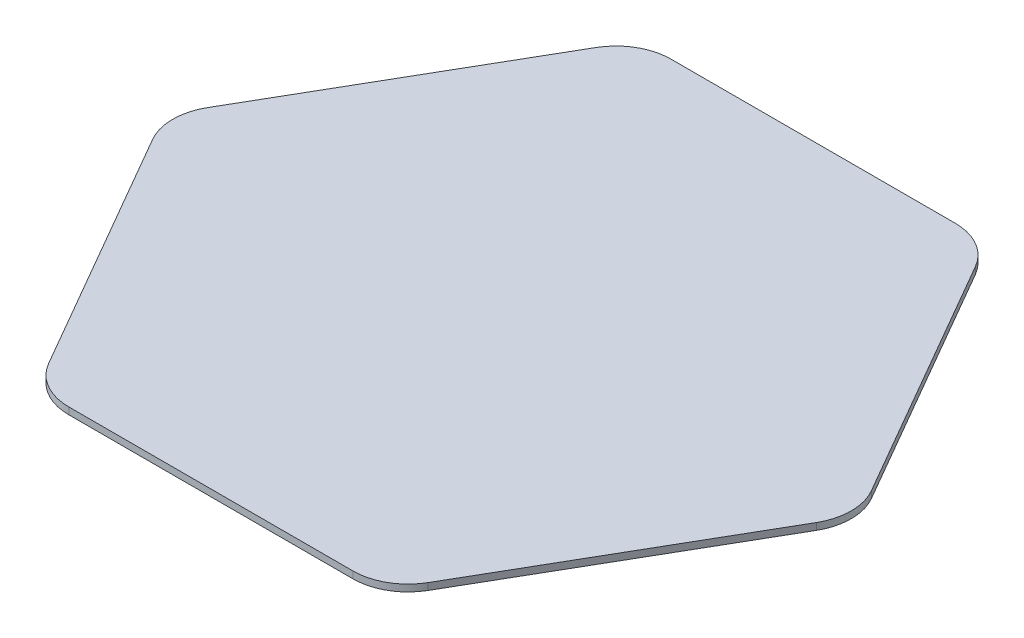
ISO-10303-21;
HEADER;
FILE_DESCRIPTION(('STEP AP214'),'2;1');
FILE_NAME('part.step','',(''),(''),'','','');
FILE_SCHEMA(('AUTOMOTIVE_DESIGN { 1 0 10303 214 1 1 1 1 }'));
ENDSEC;
DATA;
#1=APPLICATION_CONTEXT('core data for automotive mechanical design processes');
#2=APPLICATION_PROTOCOL_DEFINITION('international standard','automotive_design',2000,#1);
#3=PRODUCT_CONTEXT('',#1,'mechanical');
#4=PRODUCT('Part','Part','',(#3));
#5=PRODUCT_RELATED_PRODUCT_CATEGORY('part','',(#4));
#6=PRODUCT_DEFINITION_FORMATION('','',#4);
#7=PRODUCT_DEFINITION_CONTEXT('part definition',#1,'design');
#8=PRODUCT_DEFINITION('design','',#6,#7);
#9=PRODUCT_DEFINITION_SHAPE('','',#8);
#10=(LENGTH_UNIT() NAMED_UNIT(*) SI_UNIT(.MILLI.,.METRE.));
#11=(NAMED_UNIT(*) PLANE_ANGLE_UNIT() SI_UNIT($,.RADIAN.));
#12=(NAMED_UNIT(*) SI_UNIT($,.STERADIAN.) SOLID_ANGLE_UNIT());
#13=UNCERTAINTY_MEASURE_WITH_UNIT(LENGTH_MEASURE(1.E-05),#10,'distance_accuracy_value','');
#14=(GEOMETRIC_REPRESENTATION_CONTEXT(3) GLOBAL_UNCERTAINTY_ASSIGNED_CONTEXT((#13)) GLOBAL_UNIT_ASSIGNED_CONTEXT((#10,
#11,#12)) REPRESENTATION_CONTEXT('',''));
#15=CARTESIAN_POINT('',(0.,0.,0.));
#16=DIRECTION('',(0.,0.,1.));
#17=DIRECTION('',(1.,0.,0.));
#18=AXIS2_PLACEMENT_3D('',#15,#16,#17);
#19=CARTESIAN_POINT('',(-41.569219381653,2.,-72.));
#20=DIRECTION('',(0.,-1.,0.));
#21=DIRECTION('',(0.,0.,-1.));
#22=AXIS2_PLACEMENT_3D('',#19,#20,#21);
#23=CYLINDRICAL_SURFACE('',#22,16.1);
#24=CARTESIAN_POINT('',(-41.569219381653,0.,-72.));
#25=DIRECTION('',(0.,1.,0.));
#26=DIRECTION('',(0.,0.,1.));
#27=AXIS2_PLACEMENT_3D('',#24,#25,#26);
#28=CIRCLE('',#27,16.1);
#29=CARTESIAN_POINT('',(-41.5692193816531,0.,-88.1));
#30=VERTEX_POINT('',#29);
#31=CARTESIAN_POINT('',(-55.5122283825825,0.,-80.05));
#32=VERTEX_POINT('',#31);
#33=EDGE_CURVE('E159',#30,#32,#28,.T.);
#34=ORIENTED_EDGE('',*,*,#33,.T.);
#35=DIRECTION('',(0.,-1.,0.));
#36=VECTOR('',#35,1.);
#37=CARTESIAN_POINT('',(-55.5122283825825,2.,-80.05));
#38=LINE('',#37,#36);
#39=CARTESIAN_POINT('',(-55.5122283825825,2.,-80.05));
#40=VERTEX_POINT('',#39);
#41=EDGE_CURVE('E11',#40,#32,#38,.T.);
#42=ORIENTED_EDGE('',*,*,#41,.F.);
#43=CARTESIAN_POINT('',(-41.569219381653,2.,-72.));
#44=DIRECTION('',(0.,1.,0.));
#45=DIRECTION('',(0.,0.,1.));
#46=AXIS2_PLACEMENT_3D('',#43,#44,#45);
#47=CIRCLE('',#46,16.1);
#48=CARTESIAN_POINT('',(-41.5692193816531,2.,-88.1));
#49=VERTEX_POINT('',#48);
#50=EDGE_CURVE('E181',#49,#40,#47,.T.);
#51=ORIENTED_EDGE('',*,*,#50,.F.);
#52=DIRECTION('',(0.,-1.,0.));
#53=VECTOR('',#52,1.);
#54=CARTESIAN_POINT('',(-41.5692193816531,2.,-88.1));
#55=LINE('',#54,#53);
#56=EDGE_CURVE('E155',#49,#30,#55,.T.);
#57=ORIENTED_EDGE('',*,*,#56,.T.);
#58=EDGE_LOOP('',(#34,#42,#51,#57));
#59=FACE_BOUND('',#58,.T.);
#60=ADVANCED_FACE('F39',(#59),#23,.T.);
#61=CARTESIAN_POINT('',(-55.5122283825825,2.,-80.05));
#62=DIRECTION('',(0.866025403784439,0.,0.5));
#63=DIRECTION('',(0.499999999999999,0.,-0.866025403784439));
#64=AXIS2_PLACEMENT_3D('',#61,#62,#63);
#65=PLANE('',#64);
#66=DIRECTION('',(-0.499999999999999,0.,0.866025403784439));
#67=VECTOR('',#66,1.);
#68=CARTESIAN_POINT('',(-55.5122283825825,0.,-80.05));
#69=LINE('',#68,#67);
#70=CARTESIAN_POINT('',(-97.0814477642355,0.,-8.04999999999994));
#71=VERTEX_POINT('',#70);
#72=EDGE_CURVE('E162',#32,#71,#69,.T.);
#73=ORIENTED_EDGE('',*,*,#72,.T.);
#74=DIRECTION('',(0.,-1.,0.));
#75=VECTOR('',#74,1.);
#76=CARTESIAN_POINT('',(-97.0814477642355,2.,-8.04999999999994));
#77=LINE('',#76,#75);
#78=CARTESIAN_POINT('',(-97.0814477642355,2.,-8.04999999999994));
#79=VERTEX_POINT('',#78);
#80=EDGE_CURVE('E47',#79,#71,#77,.T.);
#81=ORIENTED_EDGE('',*,*,#80,.F.);
#82=DIRECTION('',(-0.499999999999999,0.,0.866025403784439));
#83=VECTOR('',#82,1.);
#84=CARTESIAN_POINT('',(-55.5122283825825,2.,-80.05));
#85=LINE('',#84,#83);
#86=EDGE_CURVE('E110',#40,#79,#85,.T.);
#87=ORIENTED_EDGE('',*,*,#86,.F.);
#88=ORIENTED_EDGE('',*,*,#41,.T.);
#89=EDGE_LOOP('',(#73,#81,#87,#88));
#90=FACE_BOUND('',#89,.T.);
#91=ADVANCED_FACE('F259',(#90),#65,.F.);
#92=CARTESIAN_POINT('',(-83.1384387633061,2.,0.));
#93=DIRECTION('',(0.,-1.,0.));
#94=DIRECTION('',(0.,0.,-1.));
#95=AXIS2_PLACEMENT_3D('',#92,#93,#94);
#96=CYLINDRICAL_SURFACE('',#95,16.1);
#97=CARTESIAN_POINT('',(-83.1384387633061,0.,0.));
#98=DIRECTION('',(0.,1.,0.));
#99=DIRECTION('',(0.,0.,1.));
#100=AXIS2_PLACEMENT_3D('',#97,#98,#99);
#101=CIRCLE('',#100,16.1);
#102=CARTESIAN_POINT('',(-97.0814477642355,0.,8.05000000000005));
#103=VERTEX_POINT('',#102);
#104=EDGE_CURVE('E164',#71,#103,#101,.T.);
#105=ORIENTED_EDGE('',*,*,#104,.T.);
#106=DIRECTION('',(0.,-1.,0.));
#107=VECTOR('',#106,1.);
#108=CARTESIAN_POINT('',(-97.0814477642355,2.,8.05000000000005));
#109=LINE('',#108,#107);
#110=CARTESIAN_POINT('',(-97.0814477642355,2.,8.05000000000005));
#111=VERTEX_POINT('',#110);
#112=EDGE_CURVE('E200',#111,#103,#109,.T.);
#113=ORIENTED_EDGE('',*,*,#112,.F.);
#114=CARTESIAN_POINT('',(-83.1384387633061,2.,0.));
#115=DIRECTION('',(0.,1.,0.));
#116=DIRECTION('',(0.,0.,1.));
#117=AXIS2_PLACEMENT_3D('',#114,#115,#116);
#118=CIRCLE('',#117,16.1);
#119=EDGE_CURVE('E208',#79,#111,#118,.T.);
#120=ORIENTED_EDGE('',*,*,#119,.F.);
#121=ORIENTED_EDGE('',*,*,#80,.T.);
#122=EDGE_LOOP('',(#105,#113,#120,#121));
#123=FACE_BOUND('',#122,.T.);
#124=ADVANCED_FACE('F206',(#123),#96,.T.);
#125=CARTESIAN_POINT('',(-97.0814477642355,2.,8.05000000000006));
#126=DIRECTION('',(0.866025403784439,0.,-0.5));
#127=DIRECTION('',(-0.5,0.,-0.866025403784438));
#128=AXIS2_PLACEMENT_3D('',#125,#126,#127);
#129=PLANE('',#128);
#130=DIRECTION('',(0.5,0.,0.866025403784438));
#131=VECTOR('',#130,1.);
#132=CARTESIAN_POINT('',(-97.0814477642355,0.,8.05000000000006));
#133=LINE('',#132,#131);
#134=CARTESIAN_POINT('',(-55.5122283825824,0.,80.05));
#135=VERTEX_POINT('',#134);
#136=EDGE_CURVE('E166',#103,#135,#133,.T.);
#137=ORIENTED_EDGE('',*,*,#136,.T.);
#138=DIRECTION('',(0.,-1.,0.));
#139=VECTOR('',#138,1.);
#140=CARTESIAN_POINT('',(-55.5122283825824,2.,80.05));
#141=LINE('',#140,#139);
#142=CARTESIAN_POINT('',(-55.5122283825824,2.,80.05));
#143=VERTEX_POINT('',#142);
#144=EDGE_CURVE('E197',#143,#135,#141,.T.);
#145=ORIENTED_EDGE('',*,*,#144,.F.);
#146=DIRECTION('',(0.5,0.,0.866025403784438));
#147=VECTOR('',#146,1.);
#148=CARTESIAN_POINT('',(-97.0814477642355,2.,8.05000000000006));
#149=LINE('',#148,#147);
#150=EDGE_CURVE('E226',#111,#143,#149,.T.);
#151=ORIENTED_EDGE('',*,*,#150,.F.);
#152=ORIENTED_EDGE('',*,*,#112,.T.);
#153=EDGE_LOOP('',(#137,#145,#151,#152));
#154=FACE_BOUND('',#153,.T.);
#155=ADVANCED_FACE('F217',(#154),#129,.F.);
#156=CARTESIAN_POINT('',(-41.569219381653,2.,72.));
#157=DIRECTION('',(0.,-1.,0.));
#158=DIRECTION('',(0.,0.,-1.));
#159=AXIS2_PLACEMENT_3D('',#156,#157,#158);
#160=CYLINDRICAL_SURFACE('',#159,16.1);
#161=CARTESIAN_POINT('',(-41.569219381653,0.,72.));
#162=DIRECTION('',(0.,1.,0.));
#163=DIRECTION('',(0.,0.,1.));
#164=AXIS2_PLACEMENT_3D('',#161,#162,#163);
#165=CIRCLE('',#164,16.1);
#166=CARTESIAN_POINT('',(-41.569219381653,0.,88.1));
#167=VERTEX_POINT('',#166);
#168=EDGE_CURVE('E168',#135,#167,#165,.T.);
#169=ORIENTED_EDGE('',*,*,#168,.T.);
#170=DIRECTION('',(0.,-1.,0.));
#171=VECTOR('',#170,1.);
#172=CARTESIAN_POINT('',(-41.569219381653,2.,88.1));
#173=LINE('',#172,#171);
#174=CARTESIAN_POINT('',(-41.569219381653,2.,88.1));
#175=VERTEX_POINT('',#174);
#176=EDGE_CURVE('E194',#175,#167,#173,.T.);
#177=ORIENTED_EDGE('',*,*,#176,.F.);
#178=CARTESIAN_POINT('',(-41.569219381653,2.,72.));
#179=DIRECTION('',(0.,1.,0.));
#180=DIRECTION('',(0.,0.,1.));
#181=AXIS2_PLACEMENT_3D('',#178,#179,#180);
#182=CIRCLE('',#181,16.1);
#183=EDGE_CURVE('E223',#143,#175,#182,.T.);
#184=ORIENTED_EDGE('',*,*,#183,.F.);
#185=ORIENTED_EDGE('',*,*,#144,.T.);
#186=EDGE_LOOP('',(#169,#177,#184,#185));
#187=FACE_BOUND('',#186,.T.);
#188=ADVANCED_FACE('F221',(#187),#160,.T.);
#189=CARTESIAN_POINT('',(-41.569219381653,2.,88.1));
#190=DIRECTION('',(0.,0.,-1.));
#191=DIRECTION('',(-1.,0.,0.));
#192=AXIS2_PLACEMENT_3D('',#189,#190,#191);
#193=PLANE('',#192);
#194=DIRECTION('',(1.,0.,0.));
#195=VECTOR('',#194,1.);
#196=CARTESIAN_POINT('',(-41.569219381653,0.,88.1));
#197=LINE('',#196,#195);
#198=CARTESIAN_POINT('',(41.5692193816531,0.,88.1));
#199=VERTEX_POINT('',#198);
#200=EDGE_CURVE('E170',#167,#199,#197,.T.);
#201=ORIENTED_EDGE('',*,*,#200,.T.);
#202=DIRECTION('',(0.,-1.,0.));
#203=VECTOR('',#202,1.);
#204=CARTESIAN_POINT('',(41.5692193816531,2.,88.1));
#205=LINE('',#204,#203);
#206=CARTESIAN_POINT('',(41.5692193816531,2.,88.1));
#207=VERTEX_POINT('',#206);
#208=EDGE_CURVE('E191',#207,#199,#205,.T.);
#209=ORIENTED_EDGE('',*,*,#208,.F.);
#210=DIRECTION('',(1.,0.,0.));
#211=VECTOR('',#210,1.);
#212=CARTESIAN_POINT('',(-41.569219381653,2.,88.1));
#213=LINE('',#212,#211);
#214=EDGE_CURVE('E225',#175,#207,#213,.T.);
#215=ORIENTED_EDGE('',*,*,#214,.F.);
#216=ORIENTED_EDGE('',*,*,#176,.T.);
#217=EDGE_LOOP('',(#201,#209,#215,#216));
#218=FACE_BOUND('',#217,.T.);
#219=ADVANCED_FACE('F272',(#218),#193,.F.);
#220=CARTESIAN_POINT('',(41.5692193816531,2.,72.));
#221=DIRECTION('',(0.,-1.,0.));
#222=DIRECTION('',(0.,0.,-1.));
#223=AXIS2_PLACEMENT_3D('',#220,#221,#222);
#224=CYLINDRICAL_SURFACE('',#223,16.1);
#225=CARTESIAN_POINT('',(41.5692193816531,0.,72.));
#226=DIRECTION('',(0.,1.,0.));
#227=DIRECTION('',(0.,0.,1.));
#228=AXIS2_PLACEMENT_3D('',#225,#226,#227);
#229=CIRCLE('',#228,16.1);
#230=CARTESIAN_POINT('',(55.5122283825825,0.,80.05));
#231=VERTEX_POINT('',#230);
#232=EDGE_CURVE('E172',#199,#231,#229,.T.);
#233=ORIENTED_EDGE('',*,*,#232,.T.);
#234=DIRECTION('',(0.,-1.,0.));
#235=VECTOR('',#234,1.);
#236=CARTESIAN_POINT('',(55.5122283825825,2.,80.05));
#237=LINE('',#236,#235);
#238=CARTESIAN_POINT('',(55.5122283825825,2.,80.05));
#239=VERTEX_POINT('',#238);
#240=EDGE_CURVE('E188',#239,#231,#237,.T.);
#241=ORIENTED_EDGE('',*,*,#240,.F.);
#242=CARTESIAN_POINT('',(41.5692193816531,2.,72.));
#243=DIRECTION('',(0.,1.,0.));
#244=DIRECTION('',(0.,0.,1.));
#245=AXIS2_PLACEMENT_3D('',#242,#243,#244);
#246=CIRCLE('',#245,16.1);
#247=EDGE_CURVE('E228',#207,#239,#246,.T.);
#248=ORIENTED_EDGE('',*,*,#247,.F.);
#249=ORIENTED_EDGE('',*,*,#208,.T.);
#250=EDGE_LOOP('',(#233,#241,#248,#249));
#251=FACE_BOUND('',#250,.T.);
#252=ADVANCED_FACE('F275',(#251),#224,.T.);
#253=CARTESIAN_POINT('',(55.5122283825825,2.,80.05));
#254=DIRECTION('',(-0.866025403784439,0.,-0.499999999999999));
#255=DIRECTION('',(-0.499999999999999,0.,0.866025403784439));
#256=AXIS2_PLACEMENT_3D('',#253,#254,#255);
#257=PLANE('',#256);
#258=DIRECTION('',(0.499999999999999,0.,-0.866025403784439));
#259=VECTOR('',#258,1.);
#260=CARTESIAN_POINT('',(55.5122283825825,0.,80.05));
#261=LINE('',#260,#259);
#262=CARTESIAN_POINT('',(97.0814477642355,0.,8.0499999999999));
#263=VERTEX_POINT('',#262);
#264=EDGE_CURVE('E174',#231,#263,#261,.T.);
#265=ORIENTED_EDGE('',*,*,#264,.T.);
#266=DIRECTION('',(0.,-1.,0.));
#267=VECTOR('',#266,1.);
#268=CARTESIAN_POINT('',(97.0814477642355,2.,8.0499999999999));
#269=LINE('',#268,#267);
#270=CARTESIAN_POINT('',(97.0814477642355,2.,8.0499999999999));
#271=VERTEX_POINT('',#270);
#272=EDGE_CURVE('E185',#271,#263,#269,.T.);
#273=ORIENTED_EDGE('',*,*,#272,.F.);
#274=DIRECTION('',(0.499999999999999,0.,-0.866025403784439));
#275=VECTOR('',#274,1.);
#276=CARTESIAN_POINT('',(55.5122283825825,2.,80.05));
#277=LINE('',#276,#275);
#278=EDGE_CURVE('E234',#239,#271,#277,.T.);
#279=ORIENTED_EDGE('',*,*,#278,.F.);
#280=ORIENTED_EDGE('',*,*,#240,.T.);
#281=EDGE_LOOP('',(#265,#273,#279,#280));
#282=FACE_BOUND('',#281,.T.);
#283=ADVANCED_FACE('F240',(#282),#257,.F.);
#284=CARTESIAN_POINT('',(83.1384387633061,2.,0.));
#285=DIRECTION('',(0.,-1.,0.));
#286=DIRECTION('',(0.,0.,-1.));
#287=AXIS2_PLACEMENT_3D('',#284,#285,#286);
#288=CYLINDRICAL_SURFACE('',#287,16.1);
#289=CARTESIAN_POINT('',(83.1384387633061,0.,0.));
#290=DIRECTION('',(0.,1.,0.));
#291=DIRECTION('',(0.,0.,-1.));
#292=AXIS2_PLACEMENT_3D('',#289,#290,#291);
#293=CIRCLE('',#292,16.1);
#294=CARTESIAN_POINT('',(97.0814477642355,0.,-8.05000000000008));
#295=VERTEX_POINT('',#294);
#296=EDGE_CURVE('E176',#263,#295,#293,.T.);
#297=ORIENTED_EDGE('',*,*,#296,.T.);
#298=DIRECTION('',(0.,-1.,0.));
#299=VECTOR('',#298,1.);
#300=CARTESIAN_POINT('',(97.0814477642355,2.,-8.05000000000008));
#301=LINE('',#300,#299);
#302=CARTESIAN_POINT('',(97.0814477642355,2.,-8.05000000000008));
#303=VERTEX_POINT('',#302);
#304=EDGE_CURVE('E150',#303,#295,#301,.T.);
#305=ORIENTED_EDGE('',*,*,#304,.F.);
#306=CARTESIAN_POINT('',(83.1384387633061,2.,0.));
#307=DIRECTION('',(0.,1.,0.));
#308=DIRECTION('',(0.,0.,-1.));
#309=AXIS2_PLACEMENT_3D('',#306,#307,#308);
#310=CIRCLE('',#309,16.1);
#311=EDGE_CURVE('E141',#271,#303,#310,.T.);
#312=ORIENTED_EDGE('',*,*,#311,.F.);
#313=ORIENTED_EDGE('',*,*,#272,.T.);
#314=EDGE_LOOP('',(#297,#305,#312,#313));
#315=FACE_BOUND('',#314,.T.);
#316=ADVANCED_FACE('F244',(#315),#288,.T.);
#317=CARTESIAN_POINT('',(97.0814477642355,2.,-8.05000000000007));
#318=DIRECTION('',(-0.866025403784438,0.,0.5));
#319=DIRECTION('',(0.5,0.,0.866025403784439));
#320=AXIS2_PLACEMENT_3D('',#317,#318,#319);
#321=PLANE('',#320);
#322=DIRECTION('',(-0.5,0.,-0.866025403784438));
#323=VECTOR('',#322,1.);
#324=CARTESIAN_POINT('',(97.0814477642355,0.,-8.05000000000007));
#325=LINE('',#324,#323);
#326=CARTESIAN_POINT('',(55.5122283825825,0.,-80.05));
#327=VERTEX_POINT('',#326);
#328=EDGE_CURVE('E149',#295,#327,#325,.T.);
#329=ORIENTED_EDGE('',*,*,#328,.T.);
#330=DIRECTION('',(0.,-1.,0.));
#331=VECTOR('',#330,1.);
#332=CARTESIAN_POINT('',(55.5122283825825,2.,-80.05));
#333=LINE('',#332,#331);
#334=CARTESIAN_POINT('',(55.5122283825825,2.,-80.05));
#335=VERTEX_POINT('',#334);
#336=EDGE_CURVE('E146',#335,#327,#333,.T.);
#337=ORIENTED_EDGE('',*,*,#336,.F.);
#338=DIRECTION('',(-0.5,0.,-0.866025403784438));
#339=VECTOR('',#338,1.);
#340=CARTESIAN_POINT('',(97.0814477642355,2.,-8.05000000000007));
#341=LINE('',#340,#339);
#342=EDGE_CURVE('E135',#303,#335,#341,.T.);
#343=ORIENTED_EDGE('',*,*,#342,.F.);
#344=ORIENTED_EDGE('',*,*,#304,.T.);
#345=EDGE_LOOP('',(#329,#337,#343,#344));
#346=FACE_BOUND('',#345,.T.);
#347=ADVANCED_FACE('F147',(#346),#321,.F.);
#348=CARTESIAN_POINT('',(41.5692193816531,2.,-72.));
#349=DIRECTION('',(0.,-1.,0.));
#350=DIRECTION('',(0.,0.,-1.));
#351=AXIS2_PLACEMENT_3D('',#348,#349,#350);
#352=CYLINDRICAL_SURFACE('',#351,16.1);
#353=CARTESIAN_POINT('',(41.5692193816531,0.,-72.));
#354=DIRECTION('',(0.,1.,0.));
#355=DIRECTION('',(0.,0.,1.));
#356=AXIS2_PLACEMENT_3D('',#353,#354,#355);
#357=CIRCLE('',#356,16.1);
#358=CARTESIAN_POINT('',(41.5692193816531,0.,-88.1));
#359=VERTEX_POINT('',#358);
#360=EDGE_CURVE('E96',#327,#359,#357,.T.);
#361=ORIENTED_EDGE('',*,*,#360,.T.);
#362=DIRECTION('',(0.,-1.,0.));
#363=VECTOR('',#362,1.);
#364=CARTESIAN_POINT('',(41.5692193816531,2.,-88.1));
#365=LINE('',#364,#363);
#366=CARTESIAN_POINT('',(41.5692193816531,2.,-88.1));
#367=VERTEX_POINT('',#366);
#368=EDGE_CURVE('E151',#367,#359,#365,.T.);
#369=ORIENTED_EDGE('',*,*,#368,.F.);
#370=CARTESIAN_POINT('',(41.5692193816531,2.,-72.));
#371=DIRECTION('',(0.,1.,0.));
#372=DIRECTION('',(0.,0.,1.));
#373=AXIS2_PLACEMENT_3D('',#370,#371,#372);
#374=CIRCLE('',#373,16.1);
#375=EDGE_CURVE('E139',#335,#367,#374,.T.);
#376=ORIENTED_EDGE('',*,*,#375,.F.);
#377=ORIENTED_EDGE('',*,*,#336,.T.);
#378=EDGE_LOOP('',(#361,#369,#376,#377));
#379=FACE_BOUND('',#378,.T.);
#380=ADVANCED_FACE('F153',(#379),#352,.T.);
#381=CARTESIAN_POINT('',(41.5692193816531,2.,-88.1));
#382=DIRECTION('',(0.,0.,1.));
#383=DIRECTION('',(1.,0.,0.));
#384=AXIS2_PLACEMENT_3D('',#381,#382,#383);
#385=PLANE('',#384);
#386=DIRECTION('',(-1.,0.,0.));
#387=VECTOR('',#386,1.);
#388=CARTESIAN_POINT('',(41.5692193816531,0.,-88.1));
#389=LINE('',#388,#387);
#390=EDGE_CURVE('E102',#359,#30,#389,.T.);
#391=ORIENTED_EDGE('',*,*,#390,.T.);
#392=ORIENTED_EDGE('',*,*,#56,.F.);
#393=DIRECTION('',(-1.,0.,0.));
#394=VECTOR('',#393,1.);
#395=CARTESIAN_POINT('',(41.5692193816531,2.,-88.1));
#396=LINE('',#395,#394);
#397=EDGE_CURVE('E55',#367,#49,#396,.T.);
#398=ORIENTED_EDGE('',*,*,#397,.F.);
#399=ORIENTED_EDGE('',*,*,#368,.T.);
#400=EDGE_LOOP('',(#391,#392,#398,#399));
#401=FACE_BOUND('',#400,.T.);
#402=ADVANCED_FACE('F248',(#401),#385,.F.);
#403=CARTESIAN_POINT('',(-41.569219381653,2.,-72.));
#404=DIRECTION('',(0.,1.,0.));
#405=DIRECTION('',(0.,0.,1.));
#406=AXIS2_PLACEMENT_3D('',#403,#404,#405);
#407=PLANE('',#406);
#408=ORIENTED_EDGE('',*,*,#50,.T.);
#409=ORIENTED_EDGE('',*,*,#86,.T.);
#410=ORIENTED_EDGE('',*,*,#119,.T.);
#411=ORIENTED_EDGE('',*,*,#150,.T.);
#412=ORIENTED_EDGE('',*,*,#183,.T.);
#413=ORIENTED_EDGE('',*,*,#214,.T.);
#414=ORIENTED_EDGE('',*,*,#247,.T.);
#415=ORIENTED_EDGE('',*,*,#278,.T.);
#416=ORIENTED_EDGE('',*,*,#311,.T.);
#417=ORIENTED_EDGE('',*,*,#342,.T.);
#418=ORIENTED_EDGE('',*,*,#375,.T.);
#419=ORIENTED_EDGE('',*,*,#397,.T.);
#420=EDGE_LOOP('',(#408,#409,#410,#411,#412,#413,#414,#415,#416,#417,#418,#419));
#421=FACE_BOUND('',#420,.T.);
#422=ADVANCED_FACE('F137',(#421),#407,.T.);
#423=CARTESIAN_POINT('',(-41.569219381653,0.,-72.));
#424=DIRECTION('',(0.,1.,0.));
#425=DIRECTION('',(0.,0.,1.));
#426=AXIS2_PLACEMENT_3D('',#423,#424,#425);
#427=PLANE('',#426);
#428=ORIENTED_EDGE('',*,*,#33,.F.);
#429=ORIENTED_EDGE('',*,*,#390,.F.);
#430=ORIENTED_EDGE('',*,*,#360,.F.);
#431=ORIENTED_EDGE('',*,*,#328,.F.);
#432=ORIENTED_EDGE('',*,*,#296,.F.);
#433=ORIENTED_EDGE('',*,*,#264,.F.);
#434=ORIENTED_EDGE('',*,*,#232,.F.);
#435=ORIENTED_EDGE('',*,*,#200,.F.);
#436=ORIENTED_EDGE('',*,*,#168,.F.);
#437=ORIENTED_EDGE('',*,*,#136,.F.);
#438=ORIENTED_EDGE('',*,*,#104,.F.);
#439=ORIENTED_EDGE('',*,*,#72,.F.);
#440=EDGE_LOOP('',(#428,#429,#430,#431,#432,#433,#434,#435,#436,#437,#438,#439));
#441=FACE_BOUND('',#440,.T.);
#442=ADVANCED_FACE('F212',(#441),#427,.F.);
#443=CLOSED_SHELL('',(#60,#91,#124,#155,#188,#219,#252,#283,#316,#347,#380,#402,#422,#442));
#444=MANIFOLD_SOLID_BREP('B2',#443);
#445=ADVANCED_BREP_SHAPE_REPRESENTATION('',(#18,#444),#14);
#446=SHAPE_DEFINITION_REPRESENTATION(#9,#445);
ENDSEC;
END-ISO-10303-21;
